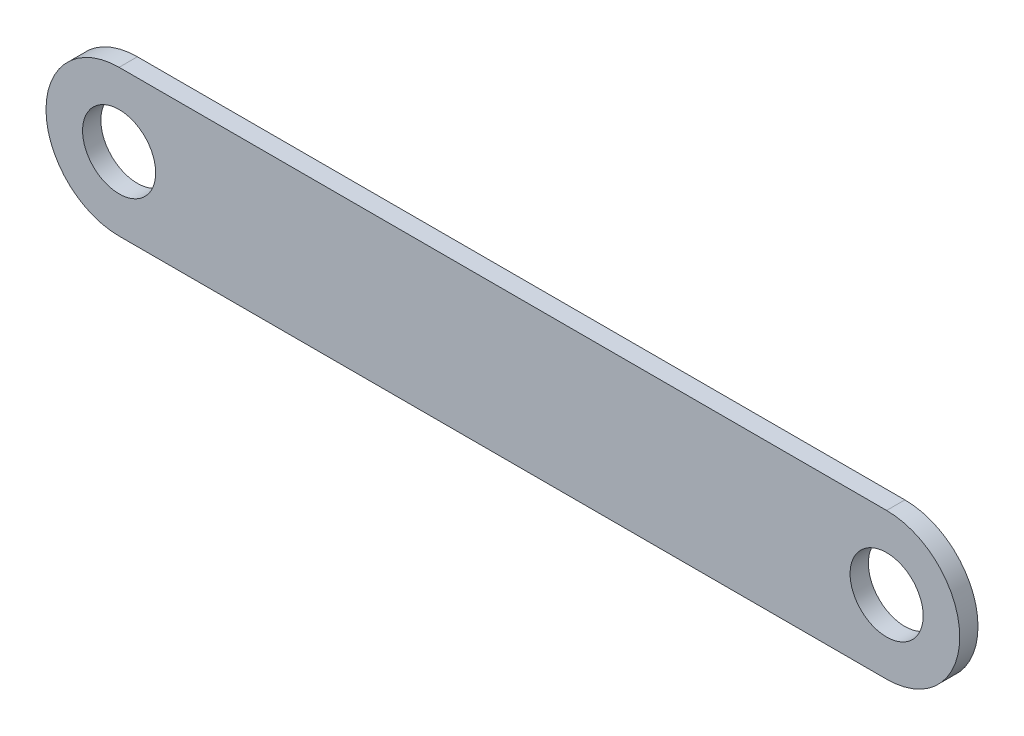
from build123d import *

# Parameters (mm, degrees)
EXTRUDE1_DEPTH     = 5
SKETCH2_R          = 10
CUT_EXTRUDE1_DEPTH = 180.853545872


with BuildPart() as part:
    # Sketch1 → Extrude1 (new body)
    with BuildSketch(Plane.XY):
        with BuildLine():
            Line((51.513050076, 21.557056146), (-158.486949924, 21.557056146))
            ThreePointArc((-158.486949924, 21.557056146), (-178.486949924, 1.557056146), (-158.486949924, -18.442943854))
            Line((-158.486949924, -18.442943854), (51.513050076, -18.442943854))
            ThreePointArc((51.513050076, -18.442943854), (71.513050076, 1.557056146), (51.513050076, 21.557056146))
        make_face()
    extrude(amount=EXTRUDE1_DEPTH)

    # Sketch2 → Cut-Extrude1 (cut, through all)
    with BuildSketch(Plane.XY.offset(5)):
        with Locations((-158.486949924, 1.557056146)):
            Circle(SKETCH2_R)
        with Locations((51.513050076, 1.557056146)):
            Circle(SKETCH2_R)
    extrude(amount=-CUT_EXTRUDE1_DEPTH, mode=Mode.SUBTRACT)


solid = part.part
